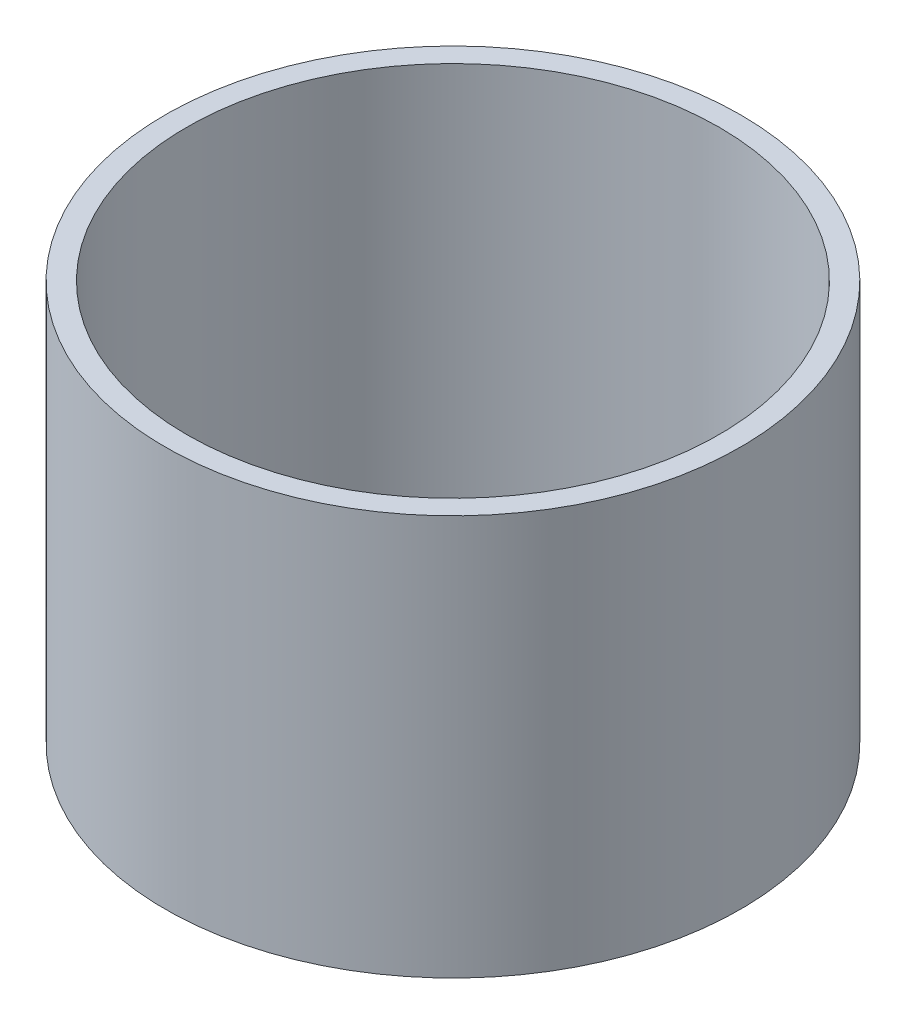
from build123d import *

# Parameters (mm, degrees)
SKETCH1_R           = 109.5375
SKETCH1_R_2         = 101.3587
BOSS_EXTRUDE1_DEPTH = 152.4


with BuildPart() as part:
    # Sketch1 → Boss-Extrude1 (new body)
    with BuildSketch(Plane(origin=(0, 0, 0), x_dir=(1, 0, 0), z_dir=(0, 1, 0))):
        with Locations(Location((0, 0, 0), (0, 0, 90))):
            Circle(SKETCH1_R)
        with Locations(Location((0, 0, 0), (0, 0, 90))):
            Circle(SKETCH1_R_2, mode=Mode.SUBTRACT)
    extrude(amount=BOSS_EXTRUDE1_DEPTH)


solid = part.part
